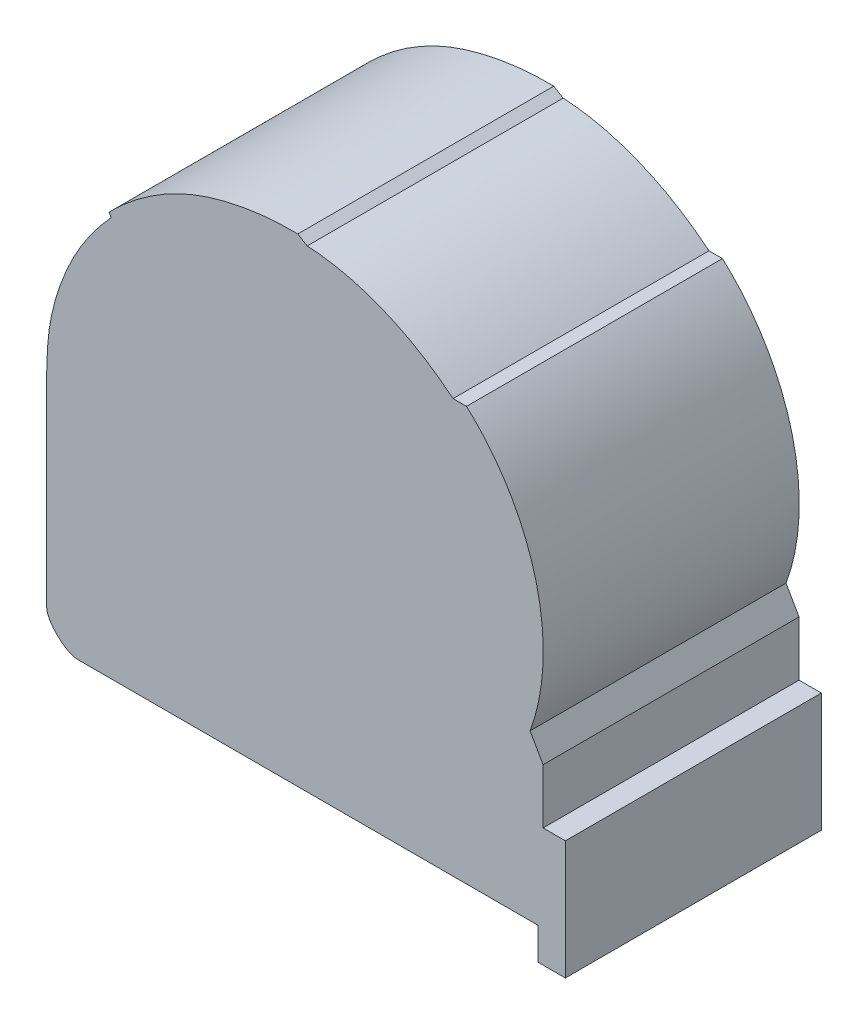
from build123d import *

# Parameters (mm, degrees)
BOSS_EXTRU_1_DEPTH = 33
ESQUISSE2_W        = 22
ESQUISSE2_H        = 37
BOSS_EXTRU_2_DEPTH = 7


with BuildPart() as part:
    # Esquisse1 → Boss.-Extru.1 (new body)
    with BuildSketch(Plane.XY):
        with BuildLine():
            Line((0, 0), (59.296163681, 0))
            Line((59.296163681, 0), (59.296163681, -4.12477552))
            Line((59.296163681, -4.12477552), (62.796163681, -4.12477552))
            Line((62.796163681, -4.12477552), (62.796163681, 11.193068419))
            Line((62.796163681, 11.193068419), (59.925664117, 11.193068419))
            Line((59.925664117, 11.193068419), (59.925664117, 18.257462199))
            Line((59.925664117, 18.257462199), (58.246996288, 21.1951309))
            add(Edge.make_bspline(
                [(58.246996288, 21.1951309), (59.73407037, 25.205866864), (61.073371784, 37.111958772), (55.596849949, 48.294383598), (50.051226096, 53.327805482)],
                knots=[0, 0, 0, 0, 0.366433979, 1, 1, 1, 1], degree=3))
            Line((50.051226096, 53.327805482), (48.31643085, 53.327805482))
            add(Edge.make_bspline(
                [(48.31643085, 53.327805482), (43.019210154, 57.666332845), (36.410435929, 60.607394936), (29.512025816, 60.972571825)],
                knots=[0, 0, 0, 0, 1, 1, 1, 1], degree=3))
            Line((29.512025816, 60.972571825), (28.300419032, 61.702642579))
            add(Edge.make_bspline(
                [(28.300419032, 61.702642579), (25.395201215, 61.765664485), (20.695880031, 61.27097898), (12.063907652, 58.647265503), (6.946773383, 55.059120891), (3.976326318, 51.974708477)],
                knots=[0, 0, 0, 0, 0.323379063, 0.522175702, 1, 1, 1, 1], degree=3))
            Line((3.976326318, 51.974708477), (4.245160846, 51.504248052))
            add(Edge.make_bspline(
                [(4.245160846, 51.504248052), (2.471827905, 49.573750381), (-0.260829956, 45.850538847), (-2.602303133, 40.28009823), (-4.10621229, 34.364377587), (-4.082601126, 30.184850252), (-4.074335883, 27.504115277)],
                knots=[0, 0, 0, 0, 0.301498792, 0.52550169, 0.69033734, 1, 1, 1, 1], degree=3))
            Line((-4.074335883, 27.504115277), (-4.074335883, 3.883047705))
            add(Edge.make_bspline(
                [(-4.074335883, 3.883047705), (-4.074335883, 3.254541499), (-3.465415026, 2.146850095), (-2.120498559, 0.762348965), (-0.845653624, 0), (0, 0)],
                knots=[0, 0, 0, 0, 0.322035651, 0.577642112, 1, 1, 1, 1], degree=3))
        make_face()
    extrude(amount=BOSS_EXTRU_1_DEPTH)

    # Esquisse2 → Boss.-Extru.2 (add)
    with BuildSketch(Plane(origin=(0, 0, 0), x_dir=(-1, 0, 0), z_dir=(0, 0, -1))):
        with Locations((-22.925664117, 27.5)):
            Rectangle(ESQUISSE2_W, ESQUISSE2_H)
    extrude(amount=BOSS_EXTRU_2_DEPTH)


solid = part.part
